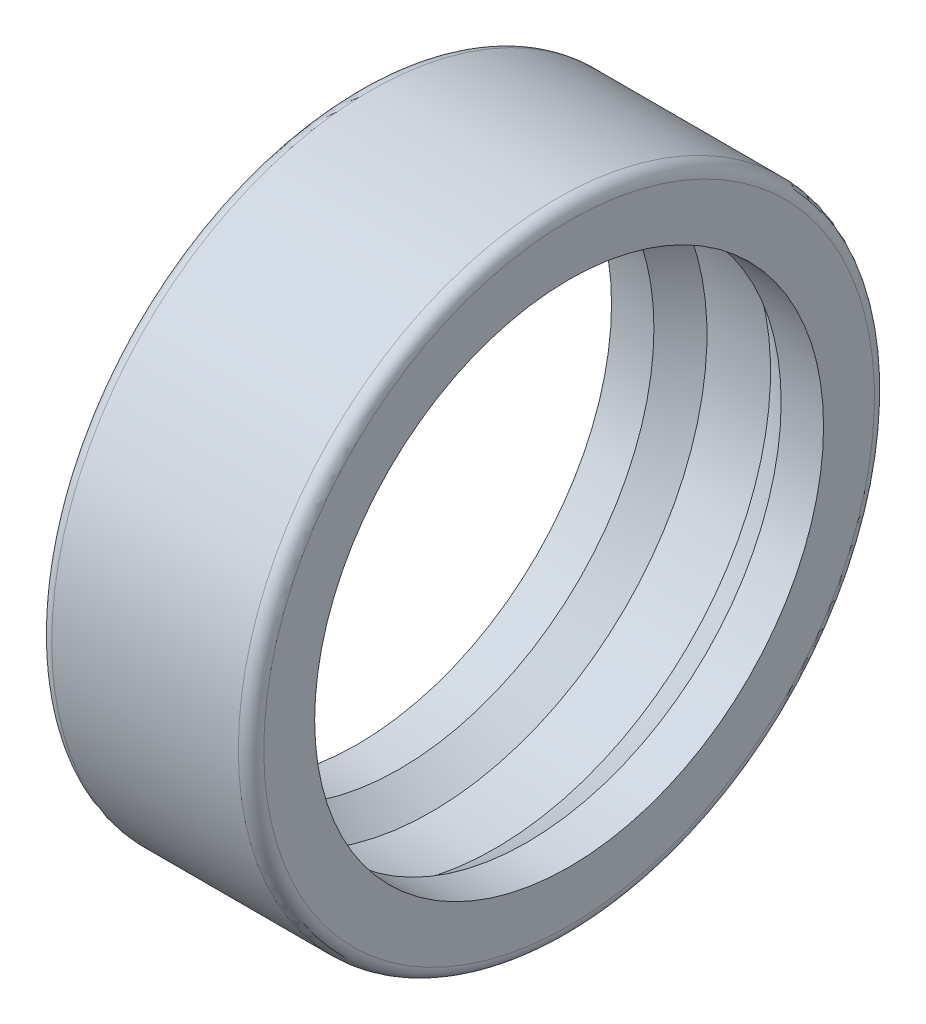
from build123d import *

# Parameters (mm, degrees)
FILLET1_R = 0.3


with BuildPart() as part:
    # Sketch1 → Revolve1 (revolve)
    with BuildSketch(Plane.XY, mode=Mode.PRIVATE) as revolve1_sk:
        Polygon((-0.75, 6.5), (0.75, 6.5), (1.5, 6), (2.5, 6), (2.5, 7.5), (-2.5, 7.5), (-2.5, 6), (-1.5, 6), align=None)
    revolve(revolve1_sk.sketch.rotate(Axis((-2.5, 0, 0), (1, 0, 0)), 90), axis=Axis((-2.5, 0, 0), (1, 0, 0)))

    # Fillet1
    fillet1_edges = [part.edges().sort_by_distance(p)[0] for p in [
        (2.5, 0, -7.5),
        (-2.5, 0, -7.5),
    ]]
    fillet(fillet1_edges, radius=FILLET1_R)


solid = part.part
